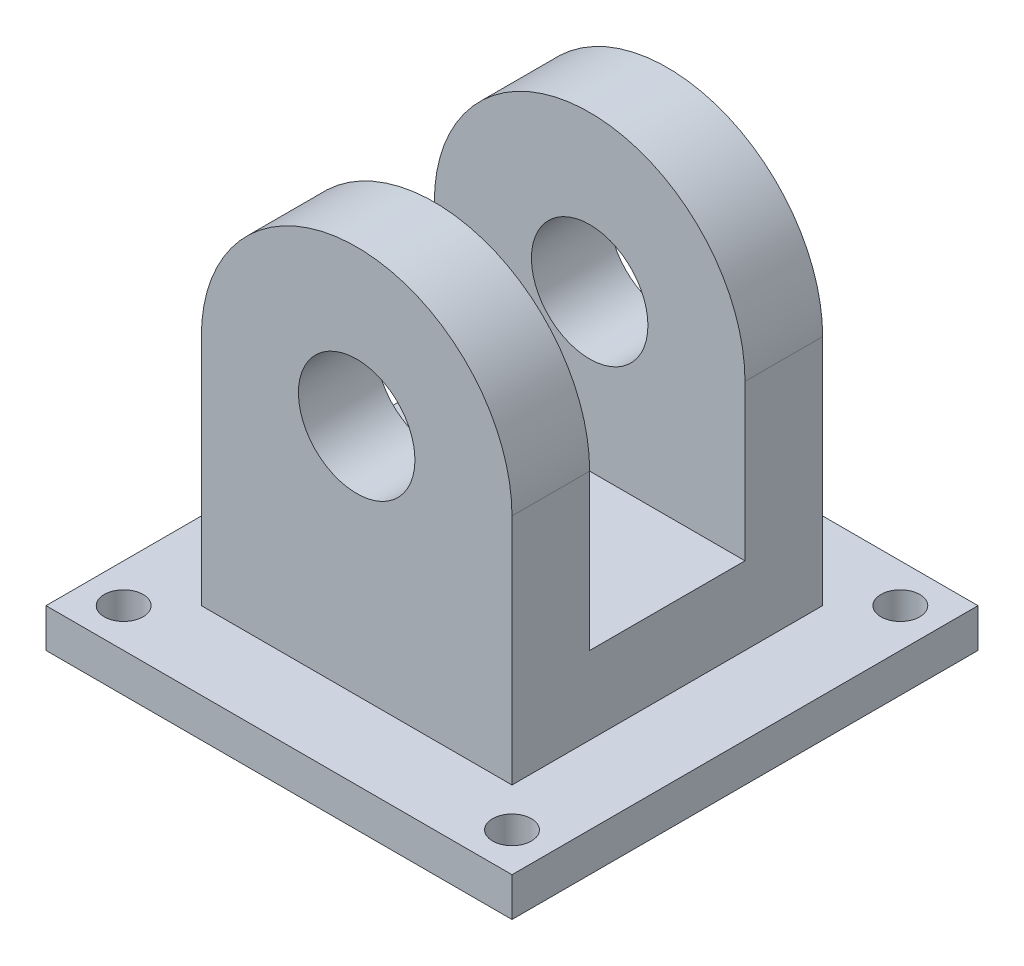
ISO-10303-21;
HEADER;
FILE_DESCRIPTION(('STEP AP214'),'2;1');
FILE_NAME('part.step','',(''),(''),'','','');
FILE_SCHEMA(('AUTOMOTIVE_DESIGN { 1 0 10303 214 1 1 1 1 }'));
ENDSEC;
DATA;
#1=APPLICATION_CONTEXT('core data for automotive mechanical design processes');
#2=APPLICATION_PROTOCOL_DEFINITION('international standard','automotive_design',2000,#1);
#3=PRODUCT_CONTEXT('',#1,'mechanical');
#4=PRODUCT('Part','Part','',(#3));
#5=PRODUCT_RELATED_PRODUCT_CATEGORY('part','',(#4));
#6=PRODUCT_DEFINITION_FORMATION('','',#4);
#7=PRODUCT_DEFINITION_CONTEXT('part definition',#1,'design');
#8=PRODUCT_DEFINITION('design','',#6,#7);
#9=PRODUCT_DEFINITION_SHAPE('','',#8);
#10=(LENGTH_UNIT() NAMED_UNIT(*) SI_UNIT(.MILLI.,.METRE.));
#11=(NAMED_UNIT(*) PLANE_ANGLE_UNIT() SI_UNIT($,.RADIAN.));
#12=(NAMED_UNIT(*) SI_UNIT($,.STERADIAN.) SOLID_ANGLE_UNIT());
#13=UNCERTAINTY_MEASURE_WITH_UNIT(LENGTH_MEASURE(1.E-05),#10,'distance_accuracy_value','');
#14=(GEOMETRIC_REPRESENTATION_CONTEXT(3) GLOBAL_UNCERTAINTY_ASSIGNED_CONTEXT((#13)) GLOBAL_UNIT_ASSIGNED_CONTEXT((#10,
#11,#12)) REPRESENTATION_CONTEXT('',''));
#15=CARTESIAN_POINT('',(0.,0.,0.));
#16=DIRECTION('',(0.,0.,1.));
#17=DIRECTION('',(1.,0.,0.));
#18=AXIS2_PLACEMENT_3D('',#15,#16,#17);
#19=CARTESIAN_POINT('',(-20.,30.,40.));
#20=DIRECTION('',(0.,0.,-1.));
#21=DIRECTION('',(-1.,0.,0.));
#22=AXIS2_PLACEMENT_3D('',#19,#20,#21);
#23=CYLINDRICAL_SURFACE('',#22,20.);
#24=DIRECTION('',(0.,0.,-1.));
#25=VECTOR('',#24,1.);
#26=CARTESIAN_POINT('',(-40.,30.,40.));
#27=LINE('',#26,#25);
#28=CARTESIAN_POINT('',(-40.,30.,10.));
#29=VERTEX_POINT('',#28);
#30=CARTESIAN_POINT('',(-40.,30.,0.));
#31=VERTEX_POINT('',#30);
#32=EDGE_CURVE('E111',#29,#31,#27,.T.);
#33=ORIENTED_EDGE('',*,*,#32,.F.);
#34=CARTESIAN_POINT('',(-20.,30.,9.99999999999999));
#35=DIRECTION('',(0.,0.,1.));
#36=DIRECTION('',(0.,-1.,0.));
#37=AXIS2_PLACEMENT_3D('',#34,#35,#36);
#38=CIRCLE('',#37,20.);
#39=CARTESIAN_POINT('',(0.,30.,10.));
#40=VERTEX_POINT('',#39);
#41=EDGE_CURVE('E83',#29,#40,#38,.F.);
#42=ORIENTED_EDGE('',*,*,#41,.T.);
#43=DIRECTION('',(0.,0.,-1.));
#44=VECTOR('',#43,1.);
#45=CARTESIAN_POINT('',(0.,30.,40.));
#46=LINE('',#45,#44);
#47=CARTESIAN_POINT('',(0.,30.,0.));
#48=VERTEX_POINT('',#47);
#49=EDGE_CURVE('E76',#40,#48,#46,.T.);
#50=ORIENTED_EDGE('',*,*,#49,.T.);
#51=CARTESIAN_POINT('',(-20.,30.,0.));
#52=DIRECTION('',(0.,0.,-1.));
#53=DIRECTION('',(-1.,0.,0.));
#54=AXIS2_PLACEMENT_3D('',#51,#52,#53);
#55=CIRCLE('',#54,20.);
#56=EDGE_CURVE('E79',#31,#48,#55,.T.);
#57=ORIENTED_EDGE('',*,*,#56,.F.);
#58=EDGE_LOOP('',(#33,#42,#50,#57));
#59=FACE_BOUND('',#58,.T.);
#60=ADVANCED_FACE('F33',(#59),#23,.T.);
#61=CARTESIAN_POINT('',(0.,30.,40.));
#62=DIRECTION('',(1.,0.,0.));
#63=DIRECTION('',(0.,0.,-1.));
#64=AXIS2_PLACEMENT_3D('',#61,#62,#63);
#65=PLANE('',#64);
#66=DIRECTION('',(0.,-1.,0.));
#67=VECTOR('',#66,1.);
#68=CARTESIAN_POINT('',(0.,57.0205337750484,30.));
#69=LINE('',#68,#67);
#70=CARTESIAN_POINT('',(0.,30.,30.));
#71=VERTEX_POINT('',#70);
#72=CARTESIAN_POINT('',(0.,10.,30.));
#73=VERTEX_POINT('',#72);
#74=EDGE_CURVE('E340',#71,#73,#69,.T.);
#75=ORIENTED_EDGE('',*,*,#74,.F.);
#76=CARTESIAN_POINT('',(0.,30.,40.));
#77=VERTEX_POINT('',#76);
#78=EDGE_CURVE('E58',#77,#71,#46,.T.);
#79=ORIENTED_EDGE('',*,*,#78,.F.);
#80=DIRECTION('',(0.,-1.,0.));
#81=VECTOR('',#80,1.);
#82=CARTESIAN_POINT('',(0.,30.,40.));
#83=LINE('',#82,#81);
#84=CARTESIAN_POINT('',(0.,0.,40.));
#85=VERTEX_POINT('',#84);
#86=EDGE_CURVE('E114',#77,#85,#83,.T.);
#87=ORIENTED_EDGE('',*,*,#86,.T.);
#88=DIRECTION('',(0.,0.,-1.));
#89=VECTOR('',#88,1.);
#90=CARTESIAN_POINT('',(0.,0.,40.));
#91=LINE('',#90,#89);
#92=CARTESIAN_POINT('',(0.,0.,0.));
#93=VERTEX_POINT('',#92);
#94=EDGE_CURVE('E100',#85,#93,#91,.T.);
#95=ORIENTED_EDGE('',*,*,#94,.T.);
#96=DIRECTION('',(0.,-1.,0.));
#97=VECTOR('',#96,1.);
#98=CARTESIAN_POINT('',(0.,30.,0.));
#99=LINE('',#98,#97);
#100=EDGE_CURVE('E93',#48,#93,#99,.T.);
#101=ORIENTED_EDGE('',*,*,#100,.F.);
#102=ORIENTED_EDGE('',*,*,#49,.F.);
#103=DIRECTION('',(0.,-1.,0.));
#104=VECTOR('',#103,1.);
#105=CARTESIAN_POINT('',(0.,57.0205337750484,10.));
#106=LINE('',#105,#104);
#107=CARTESIAN_POINT('',(0.,10.,9.99999999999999));
#108=VERTEX_POINT('',#107);
#109=EDGE_CURVE('E127',#40,#108,#106,.T.);
#110=ORIENTED_EDGE('',*,*,#109,.T.);
#111=DIRECTION('',(0.,0.,-1.));
#112=VECTOR('',#111,1.);
#113=CARTESIAN_POINT('',(0.,10.,30.));
#114=LINE('',#113,#112);
#115=EDGE_CURVE('E342',#73,#108,#114,.T.);
#116=ORIENTED_EDGE('',*,*,#115,.F.);
#117=EDGE_LOOP('',(#75,#79,#87,#95,#101,#102,#110,#116));
#118=FACE_BOUND('',#117,.T.);
#119=ADVANCED_FACE('F98',(#118),#65,.T.);
#120=CARTESIAN_POINT('',(-20.,30.,30.));
#121=DIRECTION('',(0.,0.,1.));
#122=DIRECTION('',(0.,-1.,0.));
#123=AXIS2_PLACEMENT_3D('',#120,#121,#122);
#124=CIRCLE('',#123,20.);
#125=CARTESIAN_POINT('',(-40.,30.,30.));
#126=VERTEX_POINT('',#125);
#127=EDGE_CURVE('E128',#126,#71,#124,.F.);
#128=ORIENTED_EDGE('',*,*,#127,.F.);
#129=CARTESIAN_POINT('',(-40.,30.,40.));
#130=VERTEX_POINT('',#129);
#131=EDGE_CURVE('E86',#130,#126,#27,.T.);
#132=ORIENTED_EDGE('',*,*,#131,.F.);
#133=CARTESIAN_POINT('',(-20.,30.,40.));
#134=DIRECTION('',(0.,0.,-1.));
#135=DIRECTION('',(-1.,0.,0.));
#136=AXIS2_PLACEMENT_3D('',#133,#134,#135);
#137=CIRCLE('',#136,20.);
#138=EDGE_CURVE('E139',#130,#77,#137,.T.);
#139=ORIENTED_EDGE('',*,*,#138,.T.);
#140=ORIENTED_EDGE('',*,*,#78,.T.);
#141=EDGE_LOOP('',(#128,#132,#139,#140));
#142=FACE_BOUND('',#141,.T.);
#143=ADVANCED_FACE('F173',(#142),#23,.T.);
#144=CARTESIAN_POINT('',(-40.,0.,40.));
#145=DIRECTION('',(-1.,0.,0.));
#146=DIRECTION('',(0.,0.,1.));
#147=AXIS2_PLACEMENT_3D('',#144,#145,#146);
#148=PLANE('',#147);
#149=DIRECTION('',(0.,1.,0.));
#150=VECTOR('',#149,1.);
#151=CARTESIAN_POINT('',(-40.,0.,30.));
#152=LINE('',#151,#150);
#153=CARTESIAN_POINT('',(-40.,10.,30.));
#154=VERTEX_POINT('',#153);
#155=EDGE_CURVE('E11',#154,#126,#152,.T.);
#156=ORIENTED_EDGE('',*,*,#155,.F.);
#157=DIRECTION('',(0.,0.,-1.));
#158=VECTOR('',#157,1.);
#159=CARTESIAN_POINT('',(-40.,10.,30.));
#160=LINE('',#159,#158);
#161=CARTESIAN_POINT('',(-40.,10.,9.99999999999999));
#162=VERTEX_POINT('',#161);
#163=EDGE_CURVE('E120',#154,#162,#160,.T.);
#164=ORIENTED_EDGE('',*,*,#163,.T.);
#165=DIRECTION('',(0.,1.,0.));
#166=VECTOR('',#165,1.);
#167=CARTESIAN_POINT('',(-40.,0.,9.99999999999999));
#168=LINE('',#167,#166);
#169=EDGE_CURVE('E42',#162,#29,#168,.T.);
#170=ORIENTED_EDGE('',*,*,#169,.T.);
#171=ORIENTED_EDGE('',*,*,#32,.T.);
#172=DIRECTION('',(0.,1.,0.));
#173=VECTOR('',#172,1.);
#174=CARTESIAN_POINT('',(-40.,0.,0.));
#175=LINE('',#174,#173);
#176=CARTESIAN_POINT('',(-40.,0.,0.));
#177=VERTEX_POINT('',#176);
#178=EDGE_CURVE('E95',#177,#31,#175,.T.);
#179=ORIENTED_EDGE('',*,*,#178,.F.);
#180=DIRECTION('',(0.,0.,-1.));
#181=VECTOR('',#180,1.);
#182=CARTESIAN_POINT('',(-40.,0.,40.));
#183=LINE('',#182,#181);
#184=CARTESIAN_POINT('',(-40.,0.,40.));
#185=VERTEX_POINT('',#184);
#186=EDGE_CURVE('E112',#185,#177,#183,.T.);
#187=ORIENTED_EDGE('',*,*,#186,.F.);
#188=DIRECTION('',(0.,1.,0.));
#189=VECTOR('',#188,1.);
#190=CARTESIAN_POINT('',(-40.,0.,40.));
#191=LINE('',#190,#189);
#192=EDGE_CURVE('E104',#185,#130,#191,.T.);
#193=ORIENTED_EDGE('',*,*,#192,.T.);
#194=ORIENTED_EDGE('',*,*,#131,.T.);
#195=EDGE_LOOP('',(#156,#164,#170,#171,#179,#187,#193,#194));
#196=FACE_BOUND('',#195,.T.);
#197=ADVANCED_FACE('F35',(#196),#148,.T.);
#198=CARTESIAN_POINT('',(-20.,30.,40.));
#199=DIRECTION('',(0.,0.,-1.));
#200=DIRECTION('',(-1.,0.,0.));
#201=AXIS2_PLACEMENT_3D('',#198,#199,#200);
#202=PLANE('',#201);
#203=CARTESIAN_POINT('',(-20.,30.,40.));
#204=DIRECTION('',(0.,0.,-1.));
#205=DIRECTION('',(0.,1.,0.));
#206=AXIS2_PLACEMENT_3D('',#203,#204,#205);
#207=CIRCLE('',#206,7.5);
#208=CARTESIAN_POINT('',(-20.,37.5,40.));
#209=VERTEX_POINT('',#208);
#210=EDGE_CURVE('E345',#209,#209,#207,.T.);
#211=ORIENTED_EDGE('',*,*,#210,.T.);
#212=EDGE_LOOP('',(#211));
#213=FACE_BOUND('',#212,.T.);
#214=DIRECTION('',(-1.,0.,0.));
#215=VECTOR('',#214,1.);
#216=CARTESIAN_POINT('',(0.,0.,40.));
#217=LINE('',#216,#215);
#218=EDGE_CURVE('E101',#85,#185,#217,.T.);
#219=ORIENTED_EDGE('',*,*,#218,.F.);
#220=ORIENTED_EDGE('',*,*,#86,.F.);
#221=ORIENTED_EDGE('',*,*,#138,.F.);
#222=ORIENTED_EDGE('',*,*,#192,.F.);
#223=EDGE_LOOP('',(#219,#220,#221,#222));
#224=FACE_BOUND('',#223,.T.);
#225=ADVANCED_FACE('F177',(#213,#224),#202,.F.);
#226=CARTESIAN_POINT('',(-20.,30.,0.));
#227=DIRECTION('',(0.,0.,-1.));
#228=DIRECTION('',(-1.,0.,0.));
#229=AXIS2_PLACEMENT_3D('',#226,#227,#228);
#230=PLANE('',#229);
#231=CARTESIAN_POINT('',(-20.,30.,0.));
#232=DIRECTION('',(0.,0.,-1.));
#233=DIRECTION('',(0.,1.,0.));
#234=AXIS2_PLACEMENT_3D('',#231,#232,#233);
#235=CIRCLE('',#234,7.5);
#236=CARTESIAN_POINT('',(-20.,37.5,0.));
#237=VERTEX_POINT('',#236);
#238=EDGE_CURVE('E352',#237,#237,#235,.T.);
#239=ORIENTED_EDGE('',*,*,#238,.F.);
#240=EDGE_LOOP('',(#239));
#241=FACE_BOUND('',#240,.T.);
#242=DIRECTION('',(-1.,0.,0.));
#243=VECTOR('',#242,1.);
#244=CARTESIAN_POINT('',(0.,0.,0.));
#245=LINE('',#244,#243);
#246=EDGE_CURVE('E131',#93,#177,#245,.T.);
#247=ORIENTED_EDGE('',*,*,#246,.T.);
#248=ORIENTED_EDGE('',*,*,#178,.T.);
#249=ORIENTED_EDGE('',*,*,#56,.T.);
#250=ORIENTED_EDGE('',*,*,#100,.T.);
#251=EDGE_LOOP('',(#247,#248,#249,#250));
#252=FACE_BOUND('',#251,.T.);
#253=ADVANCED_FACE('F91',(#241,#252),#230,.T.);
#254=CARTESIAN_POINT('',(-40.,57.0205337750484,30.));
#255=DIRECTION('',(0.,0.,1.));
#256=DIRECTION('',(0.,-1.,0.));
#257=AXIS2_PLACEMENT_3D('',#254,#255,#256);
#258=PLANE('',#257);
#259=CARTESIAN_POINT('',(-20.,30.,30.));
#260=DIRECTION('',(0.,0.,1.));
#261=DIRECTION('',(0.,-1.,0.));
#262=AXIS2_PLACEMENT_3D('',#259,#260,#261);
#263=CIRCLE('',#262,7.5);
#264=CARTESIAN_POINT('',(-20.,22.5,30.));
#265=VERTEX_POINT('',#264);
#266=EDGE_CURVE('E338',#265,#265,#263,.T.);
#267=ORIENTED_EDGE('',*,*,#266,.T.);
#268=EDGE_LOOP('',(#267));
#269=FACE_BOUND('',#268,.T.);
#270=ORIENTED_EDGE('',*,*,#127,.T.);
#271=ORIENTED_EDGE('',*,*,#74,.T.);
#272=DIRECTION('',(1.,0.,0.));
#273=VECTOR('',#272,1.);
#274=CARTESIAN_POINT('',(-40.,10.,30.));
#275=LINE('',#274,#273);
#276=EDGE_CURVE('E133',#154,#73,#275,.T.);
#277=ORIENTED_EDGE('',*,*,#276,.F.);
#278=ORIENTED_EDGE('',*,*,#155,.T.);
#279=EDGE_LOOP('',(#270,#271,#277,#278));
#280=FACE_BOUND('',#279,.T.);
#281=ADVANCED_FACE('F170',(#269,#280),#258,.F.);
#282=CARTESIAN_POINT('',(-40.,57.0205337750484,10.));
#283=DIRECTION('',(0.,0.,1.));
#284=DIRECTION('',(0.,-1.,0.));
#285=AXIS2_PLACEMENT_3D('',#282,#283,#284);
#286=PLANE('',#285);
#287=CARTESIAN_POINT('',(-20.,30.,9.99999999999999));
#288=DIRECTION('',(0.,0.,1.));
#289=DIRECTION('',(0.,-1.,0.));
#290=AXIS2_PLACEMENT_3D('',#287,#288,#289);
#291=CIRCLE('',#290,7.5);
#292=CARTESIAN_POINT('',(-20.,22.5,9.99999999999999));
#293=VERTEX_POINT('',#292);
#294=EDGE_CURVE('E37',#293,#293,#291,.T.);
#295=ORIENTED_EDGE('',*,*,#294,.F.);
#296=EDGE_LOOP('',(#295));
#297=FACE_BOUND('',#296,.T.);
#298=ORIENTED_EDGE('',*,*,#169,.F.);
#299=DIRECTION('',(1.,0.,0.));
#300=VECTOR('',#299,1.);
#301=CARTESIAN_POINT('',(-40.,10.,9.99999999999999));
#302=LINE('',#301,#300);
#303=EDGE_CURVE('E49',#162,#108,#302,.T.);
#304=ORIENTED_EDGE('',*,*,#303,.T.);
#305=ORIENTED_EDGE('',*,*,#109,.F.);
#306=ORIENTED_EDGE('',*,*,#41,.F.);
#307=EDGE_LOOP('',(#298,#304,#305,#306));
#308=FACE_BOUND('',#307,.T.);
#309=ADVANCED_FACE('F124',(#297,#308),#286,.T.);
#310=CARTESIAN_POINT('',(-40.,10.,30.));
#311=DIRECTION('',(0.,-1.,0.));
#312=DIRECTION('',(0.,0.,-1.));
#313=AXIS2_PLACEMENT_3D('',#310,#311,#312);
#314=PLANE('',#313);
#315=ORIENTED_EDGE('',*,*,#115,.T.);
#316=ORIENTED_EDGE('',*,*,#303,.F.);
#317=ORIENTED_EDGE('',*,*,#163,.F.);
#318=ORIENTED_EDGE('',*,*,#276,.T.);
#319=EDGE_LOOP('',(#315,#316,#317,#318));
#320=FACE_BOUND('',#319,.T.);
#321=ADVANCED_FACE('F327',(#320),#314,.F.);
#322=CARTESIAN_POINT('',(-20.,30.,40.));
#323=DIRECTION('',(0.,0.,-1.));
#324=DIRECTION('',(0.,1.,0.));
#325=AXIS2_PLACEMENT_3D('',#322,#323,#324);
#326=CYLINDRICAL_SURFACE('',#325,7.5);
#327=ORIENTED_EDGE('',*,*,#294,.T.);
#328=EDGE_LOOP('',(#327));
#329=FACE_BOUND('',#328,.T.);
#330=ORIENTED_EDGE('',*,*,#238,.T.);
#331=EDGE_LOOP('',(#330));
#332=FACE_BOUND('',#331,.T.);
#333=ADVANCED_FACE('F324',(#329,#332),#326,.F.);
#334=ORIENTED_EDGE('',*,*,#210,.F.);
#335=EDGE_LOOP('',(#334));
#336=FACE_BOUND('',#335,.T.);
#337=ORIENTED_EDGE('',*,*,#266,.F.);
#338=EDGE_LOOP('',(#337));
#339=FACE_BOUND('',#338,.T.);
#340=ADVANCED_FACE('F272',(#336,#339),#326,.F.);
#341=CARTESIAN_POINT('',(0.,0.,0.));
#342=DIRECTION('',(0.,-1.,0.));
#343=DIRECTION('',(1.,0.,0.));
#344=AXIS2_PLACEMENT_3D('',#341,#342,#343);
#345=PLANE('',#344);
#346=CARTESIAN_POINT('',(-45.,0.,45.));
#347=DIRECTION('',(0.,1.,0.));
#348=DIRECTION('',(-1.,0.,0.));
#349=AXIS2_PLACEMENT_3D('',#346,#347,#348);
#350=CIRCLE('',#349,2.5);
#351=CARTESIAN_POINT('',(-47.5,0.,45.));
#352=VERTEX_POINT('',#351);
#353=EDGE_CURVE('E410',#352,#352,#350,.T.);
#354=ORIENTED_EDGE('',*,*,#353,.F.);
#355=EDGE_LOOP('',(#354));
#356=FACE_BOUND('',#355,.T.);
#357=CARTESIAN_POINT('',(5.,0.,45.));
#358=DIRECTION('',(0.,1.,0.));
#359=DIRECTION('',(-1.,0.,0.));
#360=AXIS2_PLACEMENT_3D('',#357,#358,#359);
#361=CIRCLE('',#360,2.5);
#362=CARTESIAN_POINT('',(2.5,0.,45.));
#363=VERTEX_POINT('',#362);
#364=EDGE_CURVE('E404',#363,#363,#361,.T.);
#365=ORIENTED_EDGE('',*,*,#364,.F.);
#366=EDGE_LOOP('',(#365));
#367=FACE_BOUND('',#366,.T.);
#368=CARTESIAN_POINT('',(5.,0.,-5.));
#369=DIRECTION('',(0.,1.,0.));
#370=DIRECTION('',(-1.,0.,0.));
#371=AXIS2_PLACEMENT_3D('',#368,#369,#370);
#372=CIRCLE('',#371,2.5);
#373=CARTESIAN_POINT('',(2.5,0.,-5.));
#374=VERTEX_POINT('',#373);
#375=EDGE_CURVE('E398',#374,#374,#372,.T.);
#376=ORIENTED_EDGE('',*,*,#375,.F.);
#377=EDGE_LOOP('',(#376));
#378=FACE_BOUND('',#377,.T.);
#379=CARTESIAN_POINT('',(-45.,0.,-5.));
#380=DIRECTION('',(0.,1.,0.));
#381=DIRECTION('',(-1.,0.,0.));
#382=AXIS2_PLACEMENT_3D('',#379,#380,#381);
#383=CIRCLE('',#382,2.5);
#384=CARTESIAN_POINT('',(-47.5,0.,-5.));
#385=VERTEX_POINT('',#384);
#386=EDGE_CURVE('E392',#385,#385,#383,.T.);
#387=ORIENTED_EDGE('',*,*,#386,.F.);
#388=EDGE_LOOP('',(#387));
#389=FACE_BOUND('',#388,.T.);
#390=DIRECTION('',(0.,0.,1.));
#391=VECTOR('',#390,1.);
#392=CARTESIAN_POINT('',(10.,0.,-10.));
#393=LINE('',#392,#391);
#394=CARTESIAN_POINT('',(10.,0.,-10.));
#395=VERTEX_POINT('',#394);
#396=CARTESIAN_POINT('',(10.,0.,50.));
#397=VERTEX_POINT('',#396);
#398=EDGE_CURVE('E378',#395,#397,#393,.T.);
#399=ORIENTED_EDGE('',*,*,#398,.F.);
#400=DIRECTION('',(-1.,0.,0.));
#401=VECTOR('',#400,1.);
#402=CARTESIAN_POINT('',(10.,0.,-10.));
#403=LINE('',#402,#401);
#404=CARTESIAN_POINT('',(-50.,0.,-10.));
#405=VERTEX_POINT('',#404);
#406=EDGE_CURVE('E368',#395,#405,#403,.T.);
#407=ORIENTED_EDGE('',*,*,#406,.T.);
#408=DIRECTION('',(0.,0.,1.));
#409=VECTOR('',#408,1.);
#410=CARTESIAN_POINT('',(-50.,0.,-10.));
#411=LINE('',#410,#409);
#412=CARTESIAN_POINT('',(-50.,0.,50.));
#413=VERTEX_POINT('',#412);
#414=EDGE_CURVE('E372',#405,#413,#411,.T.);
#415=ORIENTED_EDGE('',*,*,#414,.T.);
#416=DIRECTION('',(-1.,0.,0.));
#417=VECTOR('',#416,1.);
#418=CARTESIAN_POINT('',(10.,0.,50.));
#419=LINE('',#418,#417);
#420=EDGE_CURVE('E375',#397,#413,#419,.T.);
#421=ORIENTED_EDGE('',*,*,#420,.F.);
#422=EDGE_LOOP('',(#399,#407,#415,#421));
#423=FACE_BOUND('',#422,.T.);
#424=ORIENTED_EDGE('',*,*,#94,.F.);
#425=ORIENTED_EDGE('',*,*,#218,.T.);
#426=ORIENTED_EDGE('',*,*,#186,.T.);
#427=ORIENTED_EDGE('',*,*,#246,.F.);
#428=EDGE_LOOP('',(#424,#425,#426,#427));
#429=FACE_BOUND('',#428,.T.);
#430=ADVANCED_FACE('F144',(#356,#367,#378,#389,#423,#429),#345,.F.);
#431=CARTESIAN_POINT('',(10.,-5.,-10.));
#432=DIRECTION('',(-1.,0.,0.));
#433=DIRECTION('',(0.,-1.,0.));
#434=AXIS2_PLACEMENT_3D('',#431,#432,#433);
#435=PLANE('',#434);
#436=ORIENTED_EDGE('',*,*,#398,.T.);
#437=DIRECTION('',(0.,1.,0.));
#438=VECTOR('',#437,1.);
#439=CARTESIAN_POINT('',(10.,-5.,50.));
#440=LINE('',#439,#438);
#441=CARTESIAN_POINT('',(10.,-5.,50.));
#442=VERTEX_POINT('',#441);
#443=EDGE_CURVE('E355',#442,#397,#440,.T.);
#444=ORIENTED_EDGE('',*,*,#443,.F.);
#445=DIRECTION('',(0.,0.,1.));
#446=VECTOR('',#445,1.);
#447=CARTESIAN_POINT('',(10.,-5.,-10.));
#448=LINE('',#447,#446);
#449=CARTESIAN_POINT('',(10.,-5.,-10.));
#450=VERTEX_POINT('',#449);
#451=EDGE_CURVE('E371',#450,#442,#448,.T.);
#452=ORIENTED_EDGE('',*,*,#451,.F.);
#453=DIRECTION('',(0.,1.,0.));
#454=VECTOR('',#453,1.);
#455=CARTESIAN_POINT('',(10.,-5.,-10.));
#456=LINE('',#455,#454);
#457=EDGE_CURVE('E364',#450,#395,#456,.T.);
#458=ORIENTED_EDGE('',*,*,#457,.T.);
#459=EDGE_LOOP('',(#436,#444,#452,#458));
#460=FACE_BOUND('',#459,.T.);
#461=ADVANCED_FACE('F225',(#460),#435,.F.);
#462=CARTESIAN_POINT('',(10.,-5.,50.));
#463=DIRECTION('',(0.,0.,-1.));
#464=DIRECTION('',(-1.,0.,0.));
#465=AXIS2_PLACEMENT_3D('',#462,#463,#464);
#466=PLANE('',#465);
#467=ORIENTED_EDGE('',*,*,#420,.T.);
#468=DIRECTION('',(0.,1.,0.));
#469=VECTOR('',#468,1.);
#470=CARTESIAN_POINT('',(-50.,-5.00000000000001,50.));
#471=LINE('',#470,#469);
#472=CARTESIAN_POINT('',(-50.,-5.00000000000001,50.));
#473=VERTEX_POINT('',#472);
#474=EDGE_CURVE('E358',#473,#413,#471,.T.);
#475=ORIENTED_EDGE('',*,*,#474,.F.);
#476=DIRECTION('',(-1.,0.,0.));
#477=VECTOR('',#476,1.);
#478=CARTESIAN_POINT('',(10.,-5.,50.));
#479=LINE('',#478,#477);
#480=EDGE_CURVE('E387',#442,#473,#479,.T.);
#481=ORIENTED_EDGE('',*,*,#480,.F.);
#482=ORIENTED_EDGE('',*,*,#443,.T.);
#483=EDGE_LOOP('',(#467,#475,#481,#482));
#484=FACE_BOUND('',#483,.T.);
#485=ADVANCED_FACE('F230',(#484),#466,.F.);
#486=CARTESIAN_POINT('',(-50.,-5.00000000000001,-10.));
#487=DIRECTION('',(-1.,0.,0.));
#488=DIRECTION('',(0.,-1.,0.));
#489=AXIS2_PLACEMENT_3D('',#486,#487,#488);
#490=PLANE('',#489);
#491=ORIENTED_EDGE('',*,*,#414,.F.);
#492=DIRECTION('',(0.,1.,0.));
#493=VECTOR('',#492,1.);
#494=CARTESIAN_POINT('',(-50.,-5.00000000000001,-10.));
#495=LINE('',#494,#493);
#496=CARTESIAN_POINT('',(-50.,-5.00000000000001,-10.));
#497=VERTEX_POINT('',#496);
#498=EDGE_CURVE('E361',#497,#405,#495,.T.);
#499=ORIENTED_EDGE('',*,*,#498,.F.);
#500=DIRECTION('',(0.,0.,1.));
#501=VECTOR('',#500,1.);
#502=CARTESIAN_POINT('',(-50.,-5.00000000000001,-10.));
#503=LINE('',#502,#501);
#504=EDGE_CURVE('E384',#497,#473,#503,.T.);
#505=ORIENTED_EDGE('',*,*,#504,.T.);
#506=ORIENTED_EDGE('',*,*,#474,.T.);
#507=EDGE_LOOP('',(#491,#499,#505,#506));
#508=FACE_BOUND('',#507,.T.);
#509=ADVANCED_FACE('F242',(#508),#490,.T.);
#510=CARTESIAN_POINT('',(10.,-5.,-10.));
#511=DIRECTION('',(0.,0.,-1.));
#512=DIRECTION('',(-1.,0.,0.));
#513=AXIS2_PLACEMENT_3D('',#510,#511,#512);
#514=PLANE('',#513);
#515=ORIENTED_EDGE('',*,*,#406,.F.);
#516=ORIENTED_EDGE('',*,*,#457,.F.);
#517=DIRECTION('',(-1.,0.,0.));
#518=VECTOR('',#517,1.);
#519=CARTESIAN_POINT('',(10.,-5.,-10.));
#520=LINE('',#519,#518);
#521=EDGE_CURVE('E367',#450,#497,#520,.T.);
#522=ORIENTED_EDGE('',*,*,#521,.T.);
#523=ORIENTED_EDGE('',*,*,#498,.T.);
#524=EDGE_LOOP('',(#515,#516,#522,#523));
#525=FACE_BOUND('',#524,.T.);
#526=ADVANCED_FACE('F252',(#525),#514,.T.);
#527=CARTESIAN_POINT('',(0.,-5.,0.));
#528=DIRECTION('',(0.,-1.,0.));
#529=DIRECTION('',(1.,0.,0.));
#530=AXIS2_PLACEMENT_3D('',#527,#528,#529);
#531=PLANE('',#530);
#532=CARTESIAN_POINT('',(-45.,-5.00000000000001,45.));
#533=DIRECTION('',(0.,1.,0.));
#534=DIRECTION('',(-1.,0.,0.));
#535=AXIS2_PLACEMENT_3D('',#532,#533,#534);
#536=CIRCLE('',#535,2.5);
#537=CARTESIAN_POINT('',(-47.5,-5.00000000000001,45.));
#538=VERTEX_POINT('',#537);
#539=EDGE_CURVE('E407',#538,#538,#536,.T.);
#540=ORIENTED_EDGE('',*,*,#539,.T.);
#541=EDGE_LOOP('',(#540));
#542=FACE_BOUND('',#541,.T.);
#543=CARTESIAN_POINT('',(5.,-5.00000000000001,45.));
#544=DIRECTION('',(0.,1.,0.));
#545=DIRECTION('',(-1.,0.,0.));
#546=AXIS2_PLACEMENT_3D('',#543,#544,#545);
#547=CIRCLE('',#546,2.5);
#548=CARTESIAN_POINT('',(2.5,-5.00000000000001,45.));
#549=VERTEX_POINT('',#548);
#550=EDGE_CURVE('E401',#549,#549,#547,.T.);
#551=ORIENTED_EDGE('',*,*,#550,.T.);
#552=EDGE_LOOP('',(#551));
#553=FACE_BOUND('',#552,.T.);
#554=CARTESIAN_POINT('',(5.,-5.00000000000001,-5.));
#555=DIRECTION('',(0.,1.,0.));
#556=DIRECTION('',(-1.,0.,0.));
#557=AXIS2_PLACEMENT_3D('',#554,#555,#556);
#558=CIRCLE('',#557,2.5);
#559=CARTESIAN_POINT('',(2.5,-5.00000000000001,-5.));
#560=VERTEX_POINT('',#559);
#561=EDGE_CURVE('E395',#560,#560,#558,.T.);
#562=ORIENTED_EDGE('',*,*,#561,.T.);
#563=EDGE_LOOP('',(#562));
#564=FACE_BOUND('',#563,.T.);
#565=CARTESIAN_POINT('',(-45.,-5.00000000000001,-5.));
#566=DIRECTION('',(0.,1.,0.));
#567=DIRECTION('',(-1.,0.,0.));
#568=AXIS2_PLACEMENT_3D('',#565,#566,#567);
#569=CIRCLE('',#568,2.5);
#570=CARTESIAN_POINT('',(-47.5,-5.00000000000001,-5.));
#571=VERTEX_POINT('',#570);
#572=EDGE_CURVE('E381',#571,#571,#569,.T.);
#573=ORIENTED_EDGE('',*,*,#572,.T.);
#574=EDGE_LOOP('',(#573));
#575=FACE_BOUND('',#574,.T.);
#576=ORIENTED_EDGE('',*,*,#451,.T.);
#577=ORIENTED_EDGE('',*,*,#480,.T.);
#578=ORIENTED_EDGE('',*,*,#504,.F.);
#579=ORIENTED_EDGE('',*,*,#521,.F.);
#580=EDGE_LOOP('',(#576,#577,#578,#579));
#581=FACE_BOUND('',#580,.T.);
#582=ADVANCED_FACE('F262',(#542,#553,#564,#575,#581),#531,.T.);
#583=CARTESIAN_POINT('',(-45.,-5.00000000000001,-5.));
#584=DIRECTION('',(0.,1.,0.));
#585=DIRECTION('',(-1.,0.,0.));
#586=AXIS2_PLACEMENT_3D('',#583,#584,#585);
#587=CYLINDRICAL_SURFACE('',#586,2.5);
#588=ORIENTED_EDGE('',*,*,#572,.F.);
#589=EDGE_LOOP('',(#588));
#590=FACE_BOUND('',#589,.T.);
#591=ORIENTED_EDGE('',*,*,#386,.T.);
#592=EDGE_LOOP('',(#591));
#593=FACE_BOUND('',#592,.T.);
#594=ADVANCED_FACE('F279',(#590,#593),#587,.F.);
#595=CARTESIAN_POINT('',(5.,-5.00000000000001,-5.));
#596=DIRECTION('',(0.,1.,0.));
#597=DIRECTION('',(-1.,0.,0.));
#598=AXIS2_PLACEMENT_3D('',#595,#596,#597);
#599=CYLINDRICAL_SURFACE('',#598,2.5);
#600=ORIENTED_EDGE('',*,*,#561,.F.);
#601=EDGE_LOOP('',(#600));
#602=FACE_BOUND('',#601,.T.);
#603=ORIENTED_EDGE('',*,*,#375,.T.);
#604=EDGE_LOOP('',(#603));
#605=FACE_BOUND('',#604,.T.);
#606=ADVANCED_FACE('F287',(#602,#605),#599,.F.);
#607=CARTESIAN_POINT('',(5.,-5.00000000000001,45.));
#608=DIRECTION('',(0.,1.,0.));
#609=DIRECTION('',(-1.,0.,0.));
#610=AXIS2_PLACEMENT_3D('',#607,#608,#609);
#611=CYLINDRICAL_SURFACE('',#610,2.5);
#612=ORIENTED_EDGE('',*,*,#550,.F.);
#613=EDGE_LOOP('',(#612));
#614=FACE_BOUND('',#613,.T.);
#615=ORIENTED_EDGE('',*,*,#364,.T.);
#616=EDGE_LOOP('',(#615));
#617=FACE_BOUND('',#616,.T.);
#618=ADVANCED_FACE('F297',(#614,#617),#611,.F.);
#619=CARTESIAN_POINT('',(-45.,-5.00000000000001,45.));
#620=DIRECTION('',(0.,1.,0.));
#621=DIRECTION('',(-1.,0.,0.));
#622=AXIS2_PLACEMENT_3D('',#619,#620,#621);
#623=CYLINDRICAL_SURFACE('',#622,2.5);
#624=ORIENTED_EDGE('',*,*,#539,.F.);
#625=EDGE_LOOP('',(#624));
#626=FACE_BOUND('',#625,.T.);
#627=ORIENTED_EDGE('',*,*,#353,.T.);
#628=EDGE_LOOP('',(#627));
#629=FACE_BOUND('',#628,.T.);
#630=ADVANCED_FACE('F307',(#626,#629),#623,.F.);
#631=CLOSED_SHELL('',(#60,#119,#143,#197,#225,#253,#281,#309,#321,#333,#340,#430,#461,#485,#509,
#526,#582,#594,#606,#618,#630));
#632=MANIFOLD_SOLID_BREP('B2',#631);
#633=ADVANCED_BREP_SHAPE_REPRESENTATION('',(#18,#632),#14);
#634=SHAPE_DEFINITION_REPRESENTATION(#9,#633);
ENDSEC;
END-ISO-10303-21;
